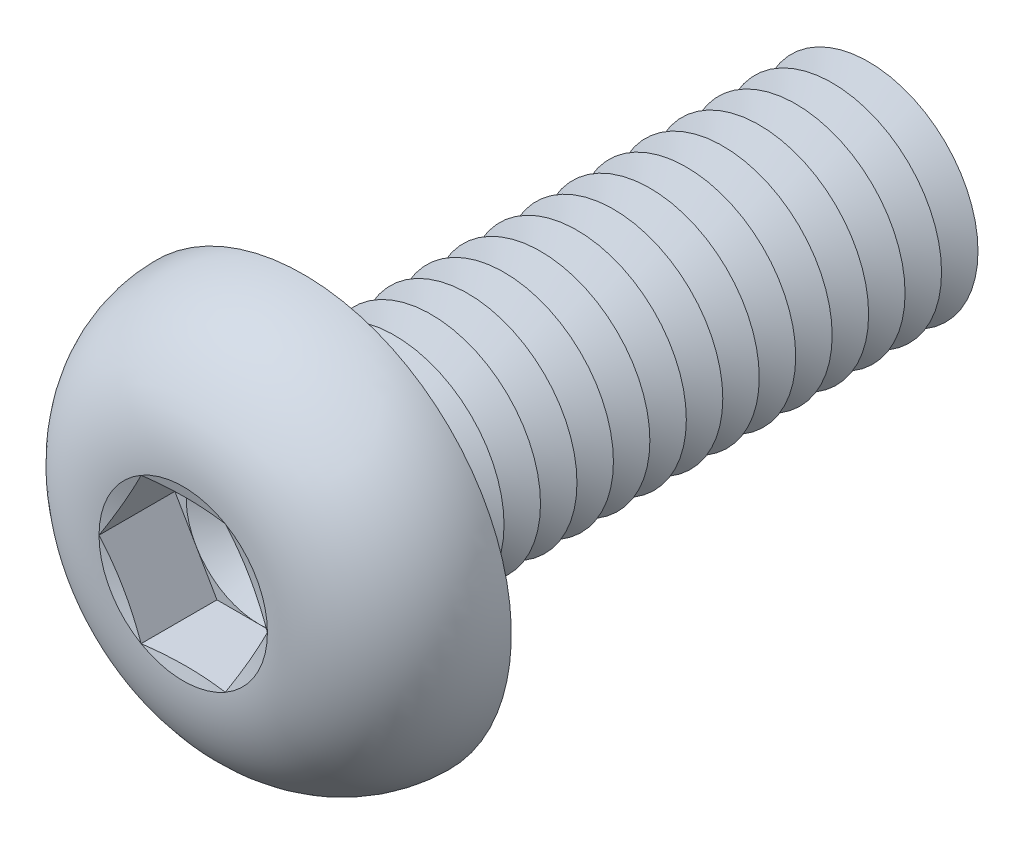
from build123d import *

# Parameters (mm, degrees)
FILLET1_R          = 0.25
LPATTERN1_COUNT    = 16
LPATTERN1_PITCH    = 0.5
CUT_EXTRUDE1_DEPTH = 1.04


with BuildPart() as part:
    # Sketch1 → Revolve1 (revolve)
    with BuildSketch(Plane(origin=(0, 0, 0), x_dir=(0, 0, -1), z_dir=(1, 0, 0)), mode=Mode.PRIVATE) as revolve1_sk:
        with BuildLine():
            Line((0, 1.5), (0, 2.85))
            ThreePointArc((0, 2.85), (-1.182850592, 2.35063849), (-1.65, 1.1547))
            Line((-1.65, 1.1547), (-1.495299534, 0.57735))
            Line((-1.495299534, 0.57735), (-1.65, 0.57735))
            Line((-1.65, 0.57735), (-1.65, 0))
            Line((-1.65, 0), (8, 0))
            Line((8, 0), (8, 1.5))
            Line((8, 1.5), (0, 1.5))
        make_face()
    revolve(revolve1_sk.sketch.rotate(Axis((0, 0, -8), (0, 0, 1)), 90), axis=Axis((0, 0, -8), (0, 0, 1)))

    # Fillet1
    fillet1_edges = [part.edges().sort_by_distance(p)[0] for p in [
        (1.5, 0, 0),
    ]]
    fillet(fillet1_edges, radius=FILLET1_R)

    # Sketch2 → Cut-Revolve1 (revolve, cut)
    with BuildSketch(Plane(origin=(0, 0, 0), x_dir=(0, 0, -1), z_dir=(1, 0, 0)), mode=Mode.PRIVATE) as cut_revolve1_sk:
        Polygon((7.75, 1.5), (8.25, 1.5), (8, 1.066987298), align=None)
    cut_revolve1 = revolve(cut_revolve1_sk.sketch.rotate(Axis((0, 0, -8), (0, 0, -1)), 270), axis=Axis((0, 0, -8), (0, 0, -1)), mode=Mode.SUBTRACT)

    # LPattern1: Cut-Revolve1 ×16
    with Locations(*[(0, 0, i * LPATTERN1_PITCH) for i in range(1, LPATTERN1_COUNT)]):
        add(cut_revolve1, mode=Mode.SUBTRACT)

    # Sketch3 → Cut-Extrude1 (cut)
    with BuildSketch(Plane.XY.offset(1.65)):
        Polygon((0.57735, 0.999999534), (-0.57735, 0.999999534), (-1.1547, 0), (-0.57735, -0.999999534), (0.57735, -0.999999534), (1.1547, 0), align=None)
    extrude(amount=-CUT_EXTRUDE1_DEPTH, mode=Mode.SUBTRACT)

    # Cut-Extrude2 cone 1 section (on through the dimple's axis) → Cut-Extrude2 (revolve, cut)
    with BuildSketch(Plane(origin=(0, 0, 0.61), x_dir=(0, -1, 0), z_dir=(1, 0, 0))):
        Polygon((0, 0), (0.999999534, 0), (0, 0.57735), align=None)
    revolve(axis=Axis((0, 0, 0.61), (0, 0, -1)), mode=Mode.SUBTRACT)


solid = part.part
